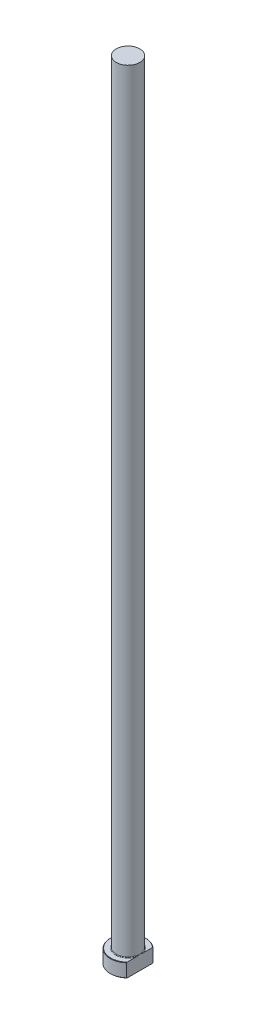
ISO-10303-21;
HEADER;
FILE_DESCRIPTION(('STEP AP214'),'2;1');
FILE_NAME('part.step','',(''),(''),'','','');
FILE_SCHEMA(('AUTOMOTIVE_DESIGN { 1 0 10303 214 1 1 1 1 }'));
ENDSEC;
DATA;
#1=APPLICATION_CONTEXT('core data for automotive mechanical design processes');
#2=APPLICATION_PROTOCOL_DEFINITION('international standard','automotive_design',2000,#1);
#3=PRODUCT_CONTEXT('',#1,'mechanical');
#4=PRODUCT('Part','Part','',(#3));
#5=PRODUCT_RELATED_PRODUCT_CATEGORY('part','',(#4));
#6=PRODUCT_DEFINITION_FORMATION('','',#4);
#7=PRODUCT_DEFINITION_CONTEXT('part definition',#1,'design');
#8=PRODUCT_DEFINITION('design','',#6,#7);
#9=PRODUCT_DEFINITION_SHAPE('','',#8);
#10=(LENGTH_UNIT() NAMED_UNIT(*) SI_UNIT(.MILLI.,.METRE.));
#11=(NAMED_UNIT(*) PLANE_ANGLE_UNIT() SI_UNIT($,.RADIAN.));
#12=(NAMED_UNIT(*) SI_UNIT($,.STERADIAN.) SOLID_ANGLE_UNIT());
#13=UNCERTAINTY_MEASURE_WITH_UNIT(LENGTH_MEASURE(1.E-05),#10,'distance_accuracy_value','');
#14=(GEOMETRIC_REPRESENTATION_CONTEXT(3) GLOBAL_UNCERTAINTY_ASSIGNED_CONTEXT((#13)) GLOBAL_UNIT_ASSIGNED_CONTEXT((#10,
#11,#12)) REPRESENTATION_CONTEXT('',''));
#15=CARTESIAN_POINT('',(0.,0.,0.));
#16=DIRECTION('',(0.,0.,1.));
#17=DIRECTION('',(1.,0.,0.));
#18=AXIS2_PLACEMENT_3D('',#15,#16,#17);
#19=CARTESIAN_POINT('',(0.,0.,0.));
#20=DIRECTION('',(0.,-1.,0.));
#21=DIRECTION('',(0.,0.,-1.));
#22=AXIS2_PLACEMENT_3D('',#19,#20,#21);
#23=PLANE('',#22);
#24=CARTESIAN_POINT('',(0.,0.,0.));
#25=DIRECTION('',(0.,-1.,0.));
#26=DIRECTION('',(0.,0.,-1.));
#27=AXIS2_PLACEMENT_3D('',#24,#25,#26);
#28=CIRCLE('',#27,8.79999999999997);
#29=CARTESIAN_POINT('',(5.99999999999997,0.,6.43739077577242));
#30=VERTEX_POINT('',#29);
#31=CARTESIAN_POINT('',(5.99999999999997,0.,-6.43739077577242));
#32=VERTEX_POINT('',#31);
#33=EDGE_CURVE('E98',#30,#32,#28,.T.);
#34=ORIENTED_EDGE('',*,*,#33,.T.);
#35=DIRECTION('',(0.,0.,1.));
#36=VECTOR('',#35,1.);
#37=CARTESIAN_POINT('',(5.99999999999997,0.,-6.70820393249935));
#38=LINE('',#37,#36);
#39=EDGE_CURVE('E83',#32,#30,#38,.T.);
#40=ORIENTED_EDGE('',*,*,#39,.T.);
#41=EDGE_LOOP('',(#34,#40));
#42=FACE_BOUND('',#41,.T.);
#43=ADVANCED_FACE('F32',(#42),#23,.T.);
#44=CARTESIAN_POINT('',(0.,259.958771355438,0.));
#45=DIRECTION('',(0.,1.,0.));
#46=DIRECTION('',(0.,0.,1.));
#47=AXIS2_PLACEMENT_3D('',#44,#45,#46);
#48=CYLINDRICAL_SURFACE('',#47,8.99999999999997);
#49=CARTESIAN_POINT('',(0.,6.79999999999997,0.));
#50=DIRECTION('',(0.,1.,0.));
#51=DIRECTION('',(0.,0.,1.));
#52=AXIS2_PLACEMENT_3D('',#49,#50,#51);
#53=CIRCLE('',#52,8.99999999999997);
#54=CARTESIAN_POINT('',(5.99999999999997,6.79999999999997,6.70820393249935));
#55=VERTEX_POINT('',#54);
#56=CARTESIAN_POINT('',(5.99999999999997,6.79999999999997,-6.70820393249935));
#57=VERTEX_POINT('',#56);
#58=EDGE_CURVE('E104',#55,#57,#53,.F.);
#59=ORIENTED_EDGE('',*,*,#58,.T.);
#60=DIRECTION('',(0.,-1.,0.));
#61=VECTOR('',#60,1.);
#62=CARTESIAN_POINT('',(5.99999999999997,400.,-6.70820393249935));
#63=LINE('',#62,#61);
#64=CARTESIAN_POINT('',(5.99999999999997,0.200000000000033,-6.70820393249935));
#65=VERTEX_POINT('',#64);
#66=EDGE_CURVE('E183',#57,#65,#63,.T.);
#67=ORIENTED_EDGE('',*,*,#66,.T.);
#68=CARTESIAN_POINT('',(0.,0.200000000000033,0.));
#69=DIRECTION('',(0.,-1.,0.));
#70=DIRECTION('',(0.,0.,-1.));
#71=AXIS2_PLACEMENT_3D('',#68,#69,#70);
#72=CIRCLE('',#71,8.99999999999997);
#73=CARTESIAN_POINT('',(5.99999999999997,0.200000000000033,6.70820393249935));
#74=VERTEX_POINT('',#73);
#75=EDGE_CURVE('E100',#65,#74,#72,.F.);
#76=ORIENTED_EDGE('',*,*,#75,.T.);
#77=DIRECTION('',(0.,-1.,0.));
#78=VECTOR('',#77,1.);
#79=CARTESIAN_POINT('',(5.99999999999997,400.,6.70820393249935));
#80=LINE('',#79,#78);
#81=EDGE_CURVE('E93',#55,#74,#80,.T.);
#82=ORIENTED_EDGE('',*,*,#81,.F.);
#83=EDGE_LOOP('',(#59,#67,#76,#82));
#84=FACE_BOUND('',#83,.T.);
#85=ADVANCED_FACE('F158',(#84),#48,.T.);
#86=CARTESIAN_POINT('',(-8.99999999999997,7.,0.));
#87=DIRECTION('',(0.,1.,0.));
#88=DIRECTION('',(0.,0.,1.));
#89=AXIS2_PLACEMENT_3D('',#86,#87,#88);
#90=PLANE('',#89);
#91=CARTESIAN_POINT('',(0.,7.,0.));
#92=DIRECTION('',(0.,1.,0.));
#93=DIRECTION('',(0.,0.,1.));
#94=AXIS2_PLACEMENT_3D('',#91,#92,#93);
#95=CIRCLE('',#94,8.79999999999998);
#96=CARTESIAN_POINT('',(5.99999999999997,7.,-6.43739077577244));
#97=VERTEX_POINT('',#96);
#98=CARTESIAN_POINT('',(5.99999999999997,7.,6.43739077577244));
#99=VERTEX_POINT('',#98);
#100=EDGE_CURVE('E178',#97,#99,#95,.T.);
#101=ORIENTED_EDGE('',*,*,#100,.T.);
#102=DIRECTION('',(0.,0.,-1.));
#103=VECTOR('',#102,1.);
#104=CARTESIAN_POINT('',(5.99999999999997,7.,0.));
#105=LINE('',#104,#103);
#106=CARTESIAN_POINT('',(5.99999999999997,6.99999999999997,1.92093727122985));
#107=VERTEX_POINT('',#106);
#108=EDGE_CURVE('E57',#99,#107,#105,.T.);
#109=ORIENTED_EDGE('',*,*,#108,.T.);
#110=CARTESIAN_POINT('',(0.,7.,0.));
#111=DIRECTION('',(0.,1.,0.));
#112=DIRECTION('',(0.,0.,1.));
#113=AXIS2_PLACEMENT_3D('',#110,#111,#112);
#114=CIRCLE('',#113,6.29999999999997);
#115=CARTESIAN_POINT('',(5.99999999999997,6.99999999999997,-1.92093727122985));
#116=VERTEX_POINT('',#115);
#117=EDGE_CURVE('E107',#107,#116,#114,.F.);
#118=ORIENTED_EDGE('',*,*,#117,.T.);
#119=EDGE_CURVE('E136',#116,#97,#105,.T.);
#120=ORIENTED_EDGE('',*,*,#119,.T.);
#121=EDGE_LOOP('',(#101,#109,#118,#120));
#122=FACE_BOUND('',#121,.T.);
#123=ADVANCED_FACE('F147',(#122),#90,.T.);
#124=CARTESIAN_POINT('',(0.,7.00000000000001,0.));
#125=DIRECTION('',(0.,-1.,0.));
#126=DIRECTION('',(0.,0.,-1.));
#127=AXIS2_PLACEMENT_3D('',#124,#125,#126);
#128=CONICAL_SURFACE('',#127,8.79999999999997,0.785398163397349);
#129=ORIENTED_EDGE('',*,*,#58,.F.);
#130=CARTESIAN_POINT('',(5.99999999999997,-0.132115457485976,14.7591430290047));
#131=CARTESIAN_POINT('',(5.99999999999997,0.0733919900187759,14.5372990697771));
#132=CARTESIAN_POINT('',(5.99999999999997,0.278550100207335,14.315131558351));
#133=CARTESIAN_POINT('',(5.99999999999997,0.688060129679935,13.8700519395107));
#134=CARTESIAN_POINT('',(5.99999999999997,0.892412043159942,13.6471398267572));
#135=CARTESIAN_POINT('',(5.99999999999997,1.50418032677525,12.9770492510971));
#136=CARTESIAN_POINT('',(5.99999999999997,1.9102209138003,12.5286117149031));
#137=CARTESIAN_POINT('',(5.99999999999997,2.7198013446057,11.624642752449));
#138=CARTESIAN_POINT('',(5.99999999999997,3.12331180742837,11.1690849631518));
#139=CARTESIAN_POINT('',(5.99999999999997,3.92341525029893,10.2520077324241));
#140=CARTESIAN_POINT('',(5.99999999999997,4.32000903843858,9.79048899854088));
#141=CARTESIAN_POINT('',(5.99999999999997,5.02478816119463,8.95241885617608));
#142=CARTESIAN_POINT('',(5.99999999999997,5.33476112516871,8.57737771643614));
#143=CARTESIAN_POINT('',(5.99999999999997,5.79310598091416,8.00939108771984));
#144=CARTESIAN_POINT('',(5.99999999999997,5.94480562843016,7.81913145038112));
#145=CARTESIAN_POINT('',(5.99999999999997,6.24553651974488,7.43651727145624));
#146=CARTESIAN_POINT('',(5.99999999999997,6.39456781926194,7.24416277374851));
#147=CARTESIAN_POINT('',(5.99999999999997,6.6892536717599,6.85721540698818));
#148=CARTESIAN_POINT('',(5.99999999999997,6.83491177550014,6.66262524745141));
#149=CARTESIAN_POINT('',(5.99999999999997,7.1223071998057,6.27057707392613));
#150=CARTESIAN_POINT('',(5.99999999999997,7.26404470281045,6.07311919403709));
#151=CARTESIAN_POINT('',(5.99999999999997,7.54263362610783,5.67488713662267));
#152=CARTESIAN_POINT('',(5.99999999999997,7.67948689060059,5.47411425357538));
#153=CARTESIAN_POINT('',(5.99999999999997,7.94714213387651,5.06858845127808));
#154=CARTESIAN_POINT('',(5.99999999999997,8.07794479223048,4.86383598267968));
#155=CARTESIAN_POINT('',(5.99999999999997,8.32827993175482,4.45554322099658));
#156=CARTESIAN_POINT('',(5.99999999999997,8.44802771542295,4.25213564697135));
#157=CARTESIAN_POINT('',(5.99999999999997,8.67837972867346,3.8401373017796));
#158=CARTESIAN_POINT('',(5.99999999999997,8.78898293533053,3.63154595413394));
#159=CARTESIAN_POINT('',(5.99999999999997,8.9984098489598,3.20863811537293));
#160=CARTESIAN_POINT('',(5.99999999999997,9.09724073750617,2.99432521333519));
#161=CARTESIAN_POINT('',(5.99999999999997,9.27991776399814,2.55937061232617));
#162=CARTESIAN_POINT('',(5.99999999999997,9.36376811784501,2.33873071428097));
#163=CARTESIAN_POINT('',(5.99999999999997,9.49627737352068,1.94012294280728));
#164=CARTESIAN_POINT('',(5.99999999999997,9.5486217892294,1.76338731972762));
#165=CARTESIAN_POINT('',(5.99999999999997,9.639780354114,1.40643307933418));
#166=CARTESIAN_POINT('',(5.99999999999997,9.67859618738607,1.22621489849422));
#167=CARTESIAN_POINT('',(5.99999999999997,9.74077317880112,0.863704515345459));
#168=CARTESIAN_POINT('',(5.99999999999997,9.76418479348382,0.681421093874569));
#169=CARTESIAN_POINT('',(5.99999999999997,9.7944781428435,0.315473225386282));
#170=CARTESIAN_POINT('',(5.99999999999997,9.80136083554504,0.131808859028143));
#171=CARTESIAN_POINT('',(5.99999999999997,9.79818788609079,-0.235881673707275));
#172=CARTESIAN_POINT('',(5.99999999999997,9.78808514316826,-0.419907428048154));
#173=CARTESIAN_POINT('',(5.99999999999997,9.75144464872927,-0.786302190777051));
#174=CARTESIAN_POINT('',(5.99999999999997,9.72490559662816,-0.968671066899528));
#175=CARTESIAN_POINT('',(5.99999999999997,9.65670736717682,-1.33110767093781));
#176=CARTESIAN_POINT('',(5.99999999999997,9.61500120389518,-1.5111664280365));
#177=CARTESIAN_POINT('',(5.99999999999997,9.5183832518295,-1.86766519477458));
#178=CARTESIAN_POINT('',(5.99999999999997,9.46347085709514,-2.04410503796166));
#179=CARTESIAN_POINT('',(5.99999999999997,9.33563659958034,-2.41270922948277));
#180=CARTESIAN_POINT('',(5.99999999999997,9.26138327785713,-2.60440790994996));
#181=CARTESIAN_POINT('',(5.99999999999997,9.10155310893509,-2.98306496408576));
#182=CARTESIAN_POINT('',(5.99999999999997,9.01597146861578,-3.1700212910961));
#183=CARTESIAN_POINT('',(5.99999999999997,8.83553473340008,-3.53975380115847));
#184=CARTESIAN_POINT('',(5.99999999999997,8.74066449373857,-3.72252253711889));
#185=CARTESIAN_POINT('',(5.99999999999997,8.5435547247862,-4.08398624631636));
#186=CARTESIAN_POINT('',(5.99999999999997,8.44131612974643,-4.26268173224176));
#187=CARTESIAN_POINT('',(5.99999999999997,8.22953960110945,-4.61872309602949));
#188=CARTESIAN_POINT('',(5.99999999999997,8.11992610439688,-4.79602381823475));
#189=CARTESIAN_POINT('',(5.99999999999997,7.8957104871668,-5.14743548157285));
#190=CARTESIAN_POINT('',(5.99999999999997,7.7811082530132,-5.32154634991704));
#191=CARTESIAN_POINT('',(5.99999999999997,7.5479278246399,-5.66682327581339));
#192=CARTESIAN_POINT('',(5.99999999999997,7.42935372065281,-5.83799210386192));
#193=CARTESIAN_POINT('',(5.99999999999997,7.18881616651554,-6.17793707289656));
#194=CARTESIAN_POINT('',(5.99999999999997,7.06685256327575,-6.34671310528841));
#195=CARTESIAN_POINT('',(5.99999999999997,6.80539778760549,-6.70216781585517));
#196=CARTESIAN_POINT('',(5.99999999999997,6.66554966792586,-6.88858356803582));
#197=CARTESIAN_POINT('',(5.99999999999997,6.38292065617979,-7.25918139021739));
#198=CARTESIAN_POINT('',(5.99999999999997,6.2401396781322,-7.44336339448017));
#199=CARTESIAN_POINT('',(5.99999999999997,5.80812002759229,-7.99307414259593));
#200=CARTESIAN_POINT('',(5.99999999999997,5.51523002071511,-8.35573349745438));
#201=CARTESIAN_POINT('',(5.99999999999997,4.92224619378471,-9.07562940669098));
#202=CARTESIAN_POINT('',(5.99999999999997,4.62214609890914,-9.43286076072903));
#203=CARTESIAN_POINT('',(5.99999999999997,4.01677382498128,-10.1429201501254));
#204=CARTESIAN_POINT('',(5.99999999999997,3.71150152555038,-10.495748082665));
#205=CARTESIAN_POINT('',(5.99999999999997,3.1145679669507,-11.177916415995));
#206=CARTESIAN_POINT('',(5.99999999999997,2.82312451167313,-11.5074478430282));
#207=CARTESIAN_POINT('',(5.99999999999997,2.23747184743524,-12.1640528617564));
#208=CARTESIAN_POINT('',(5.99999999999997,1.94326258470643,-12.4911264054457));
#209=CARTESIAN_POINT('',(5.99999999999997,1.35320776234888,-13.1426363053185));
#210=CARTESIAN_POINT('',(5.99999999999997,1.05736649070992,-13.4670765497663));
#211=CARTESIAN_POINT('',(5.99999999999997,0.463882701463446,-14.1142803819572));
#212=CARTESIAN_POINT('',(5.99999999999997,0.166240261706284,-14.4370440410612));
#213=CARTESIAN_POINT('',(5.99999999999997,-0.132115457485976,-14.7591430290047));
#214=B_SPLINE_CURVE_WITH_KNOTS('',3,(#130,#131,#132,#133,#134,#135,#136,#137,#138,#139,#140,
#141,#142,#143,#144,#145,#146,#147,#148,#149,#150,#151,#152,#153,#154,#155,#156,#157,#158,#159,
#160,#161,#162,#163,#164,#165,#166,#167,#168,#169,#170,#171,#172,#173,#174,#175,#176,#177,#178,
#179,#180,#181,#182,#183,#184,#185,#186,#187,#188,#189,#190,#191,#192,#193,#194,#195,#196,#197,
#198,#199,#200,#201,#202,#203,#204,#205,#206,#207,#208,#209,#210,#211,#212,#213),.UNSPECIFIED.,
.F.,.F.,(4,2,2,2,2,2,2,2,2,2,2,2,2,2,2,2,2,2,2,2,2,2,2,2,2,2,2,2,2,2,2,2,2,2,2,2,2,2,2,2,2,4),
(0.,0.907210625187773,1.81442776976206,3.62925156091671,5.4549048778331,7.28034345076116,
8.73990838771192,9.4698921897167,10.1998607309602,10.9290223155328,11.6581499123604,
12.3869992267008,13.1157664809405,13.8236973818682,14.5317073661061,15.2392832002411,
15.9466595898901,16.4991819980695,17.0516356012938,17.6022705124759,18.1528735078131,
18.7050058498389,19.2571818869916,19.8110832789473,20.3650100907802,20.9812908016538,
21.597833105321,22.2153979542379,22.8328846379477,23.4581285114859,24.0833866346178,
24.7080195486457,25.3326807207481,26.0317691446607,26.7308780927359,28.1292235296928,
29.5288334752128,30.9284760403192,32.2482200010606,33.567989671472,34.8851960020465,
36.2023458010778),.UNSPECIFIED.);
#215=EDGE_CURVE('E135',#55,#99,#214,.T.);
#216=ORIENTED_EDGE('',*,*,#215,.T.);
#217=ORIENTED_EDGE('',*,*,#100,.F.);
#218=EDGE_CURVE('E127',#97,#57,#214,.T.);
#219=ORIENTED_EDGE('',*,*,#218,.T.);
#220=EDGE_LOOP('',(#129,#216,#217,#219));
#221=FACE_BOUND('',#220,.T.);
#222=ADVANCED_FACE('F143',(#221),#128,.T.);
#223=CARTESIAN_POINT('',(0.,0.200000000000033,0.));
#224=DIRECTION('',(0.,1.,0.));
#225=DIRECTION('',(0.,0.,1.));
#226=AXIS2_PLACEMENT_3D('',#223,#224,#225);
#227=CONICAL_SURFACE('',#226,8.99999999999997,0.785398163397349);
#228=ORIENTED_EDGE('',*,*,#75,.F.);
#229=CARTESIAN_POINT('',(5.99999999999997,7.13211545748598,-14.7591430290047));
#230=CARTESIAN_POINT('',(5.99999999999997,6.92660800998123,-14.5372990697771));
#231=CARTESIAN_POINT('',(5.99999999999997,6.72144989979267,-14.315131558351));
#232=CARTESIAN_POINT('',(5.99999999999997,6.31193987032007,-13.8700519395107));
#233=CARTESIAN_POINT('',(5.99999999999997,6.10758795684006,-13.6471398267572));
#234=CARTESIAN_POINT('',(5.99999999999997,5.49581967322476,-12.9770492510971));
#235=CARTESIAN_POINT('',(5.99999999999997,5.08977908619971,-12.5286117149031));
#236=CARTESIAN_POINT('',(5.99999999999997,4.28019865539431,-11.624642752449));
#237=CARTESIAN_POINT('',(5.99999999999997,3.87668819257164,-11.1690849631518));
#238=CARTESIAN_POINT('',(5.99999999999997,3.07658474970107,-10.2520077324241));
#239=CARTESIAN_POINT('',(5.99999999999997,2.67999096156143,-9.79048899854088));
#240=CARTESIAN_POINT('',(5.99999999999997,1.97521183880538,-8.95241885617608));
#241=CARTESIAN_POINT('',(5.99999999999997,1.6652388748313,-8.57737771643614));
#242=CARTESIAN_POINT('',(5.99999999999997,1.20689401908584,-8.00939108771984));
#243=CARTESIAN_POINT('',(5.99999999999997,1.05519437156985,-7.81913145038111));
#244=CARTESIAN_POINT('',(5.99999999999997,0.754463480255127,-7.43651727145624));
#245=CARTESIAN_POINT('',(5.99999999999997,0.60543218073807,-7.24416277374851));
#246=CARTESIAN_POINT('',(5.99999999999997,0.310746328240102,-6.85721540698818));
#247=CARTESIAN_POINT('',(5.99999999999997,0.16508822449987,-6.66262524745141));
#248=CARTESIAN_POINT('',(5.99999999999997,-0.122307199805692,-6.27057707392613));
#249=CARTESIAN_POINT('',(5.99999999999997,-0.264044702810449,-6.07311919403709));
#250=CARTESIAN_POINT('',(5.99999999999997,-0.542633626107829,-5.67488713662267));
#251=CARTESIAN_POINT('',(5.99999999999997,-0.679486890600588,-5.47411425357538));
#252=CARTESIAN_POINT('',(5.99999999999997,-0.947142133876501,-5.06858845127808));
#253=CARTESIAN_POINT('',(5.99999999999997,-1.07794479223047,-4.86383598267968));
#254=CARTESIAN_POINT('',(5.99999999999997,-1.32827993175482,-4.45554322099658));
#255=CARTESIAN_POINT('',(5.99999999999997,-1.44802771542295,-4.25213564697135));
#256=CARTESIAN_POINT('',(5.99999999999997,-1.67837972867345,-3.8401373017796));
#257=CARTESIAN_POINT('',(5.99999999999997,-1.78898293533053,-3.63154595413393));
#258=CARTESIAN_POINT('',(5.99999999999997,-1.99840984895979,-3.20863811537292));
#259=CARTESIAN_POINT('',(5.99999999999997,-2.09724073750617,-2.99432521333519));
#260=CARTESIAN_POINT('',(5.99999999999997,-2.27991776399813,-2.55937061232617));
#261=CARTESIAN_POINT('',(5.99999999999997,-2.363768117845,-2.33873071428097));
#262=CARTESIAN_POINT('',(5.99999999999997,-2.49627737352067,-1.94012294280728));
#263=CARTESIAN_POINT('',(5.99999999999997,-2.54862178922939,-1.76338731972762));
#264=CARTESIAN_POINT('',(5.99999999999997,-2.63978035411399,-1.40643307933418));
#265=CARTESIAN_POINT('',(5.99999999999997,-2.67859618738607,-1.22621489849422));
#266=CARTESIAN_POINT('',(5.99999999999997,-2.74077317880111,-0.86370451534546));
#267=CARTESIAN_POINT('',(5.99999999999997,-2.76418479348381,-0.681421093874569));
#268=CARTESIAN_POINT('',(5.99999999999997,-2.79447814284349,-0.315473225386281));
#269=CARTESIAN_POINT('',(5.99999999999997,-2.80136083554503,-0.131808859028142));
#270=CARTESIAN_POINT('',(5.99999999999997,-2.79818788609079,0.235881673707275));
#271=CARTESIAN_POINT('',(5.99999999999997,-2.78808514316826,0.419907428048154));
#272=CARTESIAN_POINT('',(5.99999999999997,-2.75144464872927,0.786302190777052));
#273=CARTESIAN_POINT('',(5.99999999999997,-2.72490559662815,0.96867106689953));
#274=CARTESIAN_POINT('',(5.99999999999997,-2.65670736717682,1.33110767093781));
#275=CARTESIAN_POINT('',(5.99999999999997,-2.61500120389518,1.5111664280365));
#276=CARTESIAN_POINT('',(5.99999999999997,-2.5183832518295,1.86766519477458));
#277=CARTESIAN_POINT('',(5.99999999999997,-2.46347085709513,2.04410503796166));
#278=CARTESIAN_POINT('',(5.99999999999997,-2.33563659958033,2.41270922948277));
#279=CARTESIAN_POINT('',(5.99999999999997,-2.26138327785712,2.60440790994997));
#280=CARTESIAN_POINT('',(5.99999999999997,-2.10155310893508,2.98306496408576));
#281=CARTESIAN_POINT('',(5.99999999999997,-2.01597146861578,3.17002129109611));
#282=CARTESIAN_POINT('',(5.99999999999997,-1.83553473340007,3.53975380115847));
#283=CARTESIAN_POINT('',(5.99999999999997,-1.74066449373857,3.7225225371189));
#284=CARTESIAN_POINT('',(5.99999999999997,-1.54355472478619,4.08398624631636));
#285=CARTESIAN_POINT('',(5.99999999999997,-1.44131612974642,4.26268173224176));
#286=CARTESIAN_POINT('',(5.99999999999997,-1.22953960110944,4.6187230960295));
#287=CARTESIAN_POINT('',(5.99999999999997,-1.11992610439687,4.79602381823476));
#288=CARTESIAN_POINT('',(5.99999999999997,-0.895710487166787,5.14743548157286));
#289=CARTESIAN_POINT('',(5.99999999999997,-0.781108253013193,5.32154634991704));
#290=CARTESIAN_POINT('',(5.99999999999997,-0.547927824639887,5.6668232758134));
#291=CARTESIAN_POINT('',(5.99999999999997,-0.429353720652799,5.83799210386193));
#292=CARTESIAN_POINT('',(5.99999999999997,-0.188816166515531,6.17793707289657));
#293=CARTESIAN_POINT('',(5.99999999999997,-0.066852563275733,6.34671310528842));
#294=CARTESIAN_POINT('',(5.99999999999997,0.194602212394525,6.70216781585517));
#295=CARTESIAN_POINT('',(5.99999999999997,0.334450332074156,6.88858356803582));
#296=CARTESIAN_POINT('',(5.99999999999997,0.61707934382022,7.2591813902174));
#297=CARTESIAN_POINT('',(5.99999999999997,0.759860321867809,7.44336339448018));
#298=CARTESIAN_POINT('',(5.99999999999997,1.19187997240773,7.99307414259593));
#299=CARTESIAN_POINT('',(5.99999999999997,1.4847699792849,8.35573349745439));
#300=CARTESIAN_POINT('',(5.99999999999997,2.0777538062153,9.07562940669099));
#301=CARTESIAN_POINT('',(5.99999999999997,2.37785390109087,9.43286076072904));
#302=CARTESIAN_POINT('',(5.99999999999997,2.98322617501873,10.1429201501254));
#303=CARTESIAN_POINT('',(5.99999999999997,3.28849847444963,10.495748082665));
#304=CARTESIAN_POINT('',(5.99999999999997,3.88543203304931,11.177916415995));
#305=CARTESIAN_POINT('',(5.99999999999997,4.17687548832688,11.5074478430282));
#306=CARTESIAN_POINT('',(5.99999999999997,4.76252815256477,12.1640528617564));
#307=CARTESIAN_POINT('',(5.99999999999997,5.05673741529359,12.4911264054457));
#308=CARTESIAN_POINT('',(5.99999999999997,5.64679223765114,13.1426363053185));
#309=CARTESIAN_POINT('',(5.99999999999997,5.94263350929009,13.4670765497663));
#310=CARTESIAN_POINT('',(5.99999999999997,6.53611729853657,14.1142803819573));
#311=CARTESIAN_POINT('',(5.99999999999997,6.83375973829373,14.4370440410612));
#312=CARTESIAN_POINT('',(5.99999999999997,7.13211545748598,14.7591430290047));
#313=B_SPLINE_CURVE_WITH_KNOTS('',3,(#229,#230,#231,#232,#233,#234,#235,#236,#237,#238,#239,
#240,#241,#242,#243,#244,#245,#246,#247,#248,#249,#250,#251,#252,#253,#254,#255,#256,#257,#258,
#259,#260,#261,#262,#263,#264,#265,#266,#267,#268,#269,#270,#271,#272,#273,#274,#275,#276,#277,
#278,#279,#280,#281,#282,#283,#284,#285,#286,#287,#288,#289,#290,#291,#292,#293,#294,#295,#296,
#297,#298,#299,#300,#301,#302,#303,#304,#305,#306,#307,#308,#309,#310,#311,#312),.UNSPECIFIED.,
.F.,.F.,(4,2,2,2,2,2,2,2,2,2,2,2,2,2,2,2,2,2,2,2,2,2,2,2,2,2,2,2,2,2,2,2,2,2,2,2,2,2,2,2,2,4),
(0.,0.907210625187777,1.81442776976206,3.62925156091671,5.4549048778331,7.28034345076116,
8.73990838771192,9.46989218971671,10.1998607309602,10.9290223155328,11.6581499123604,
12.3869992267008,13.1157664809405,13.8236973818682,14.5317073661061,15.2392832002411,
15.9466595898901,16.4991819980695,17.0516356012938,17.6022705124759,18.1528735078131,
18.7050058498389,19.2571818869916,19.8110832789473,20.3650100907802,20.9812908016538,
21.597833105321,22.215397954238,22.8328846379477,23.4581285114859,24.0833866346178,
24.7080195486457,25.3326807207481,26.0317691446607,26.7308780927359,28.1292235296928,
29.5288334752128,30.9284760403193,32.2482200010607,33.567989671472,34.8851960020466,
36.2023458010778),.UNSPECIFIED.);
#314=EDGE_CURVE('E86',#65,#32,#313,.T.);
#315=ORIENTED_EDGE('',*,*,#314,.T.);
#316=ORIENTED_EDGE('',*,*,#33,.F.);
#317=EDGE_CURVE('E89',#30,#74,#313,.T.);
#318=ORIENTED_EDGE('',*,*,#317,.T.);
#319=EDGE_LOOP('',(#228,#315,#316,#318));
#320=FACE_BOUND('',#319,.T.);
#321=ADVANCED_FACE('F97',(#320),#227,.T.);
#322=CARTESIAN_POINT('',(0.,7.29999999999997,0.));
#323=DIRECTION('',(0.,1.,0.));
#324=DIRECTION('',(0.,0.,1.));
#325=AXIS2_PLACEMENT_3D('',#322,#323,#324);
#326=TOROIDAL_SURFACE('',#325,6.29999999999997,0.3);
#327=CARTESIAN_POINT('',(5.99999999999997,7.29999999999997,0.));
#328=CARTESIAN_POINT('',(5.99999999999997,7.30000062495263,1.34604287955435E-10));
#329=CARTESIAN_POINT('',(5.99999999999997,7.30000124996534,-2.85495107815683E-07));
#330=CARTESIAN_POINT('',(5.99999999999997,7.30000241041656,-1.04928090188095E-06));
#331=CARTESIAN_POINT('',(5.99999999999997,7.30000292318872,-1.54785170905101E-06));
#332=CARTESIAN_POINT('',(5.99999999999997,7.30000401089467,-2.74944383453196E-06));
#333=CARTESIAN_POINT('',(5.99999999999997,7.30000456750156,-3.47196539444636E-06));
#334=CARTESIAN_POINT('',(5.99999999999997,7.30000554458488,-4.95172582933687E-06));
#335=CARTESIAN_POINT('',(5.99999999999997,7.30000596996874,-5.70604365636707E-06));
#336=CARTESIAN_POINT('',(5.99999999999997,7.30000759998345,-8.69525109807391E-06));
#337=CARTESIAN_POINT('',(5.99999999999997,7.30000872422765,-1.0978182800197E-05));
#338=CARTESIAN_POINT('',(5.99999999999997,7.30001052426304,-1.54456346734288E-05));
#339=CARTESIAN_POINT('',(5.99999999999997,7.3000112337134,-1.76170762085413E-05));
#340=CARTESIAN_POINT('',(5.99999999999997,7.30001429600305,-2.69928123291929E-05));
#341=CARTESIAN_POINT('',(5.99999999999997,7.30001664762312,-3.42000265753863E-05));
#342=CARTESIAN_POINT('',(5.99999999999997,7.30002002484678,-4.76829001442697E-05));
#343=CARTESIAN_POINT('',(5.99999999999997,7.30002120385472,-5.39195609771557E-05));
#344=CARTESIAN_POINT('',(5.99999999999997,7.30002992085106,-0.000100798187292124));
#345=CARTESIAN_POINT('',(5.99999999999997,7.30003667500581,-0.00014152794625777));
#346=CARTESIAN_POINT('',(5.99999999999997,7.30006623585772,-0.000303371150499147));
#347=CARTESIAN_POINT('',(5.99999999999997,7.30009428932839,-0.000423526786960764));
#348=CARTESIAN_POINT('',(5.99999999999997,7.30020425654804,-0.000901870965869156));
#349=CARTESIAN_POINT('',(5.99999999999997,7.3002828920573,-0.00126055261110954));
#350=CARTESIAN_POINT('',(5.99999999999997,7.30059934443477,-0.0026940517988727));
#351=CARTESIAN_POINT('',(5.99999999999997,7.3008413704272,-0.0037682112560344));
#352=CARTESIAN_POINT('',(5.99999999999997,7.30185255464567,-0.0082672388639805));
#353=CARTESIAN_POINT('',(5.99999999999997,7.30261638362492,-0.0116929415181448));
#354=CARTESIAN_POINT('',(5.99999999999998,7.30945824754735,-0.0423635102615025));
#355=CARTESIAN_POINT('',(5.99999999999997,7.31555811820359,-0.0696050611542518));
#356=CARTESIAN_POINT('',(5.99999999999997,7.32747716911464,-0.122985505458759));
#357=CARTESIAN_POINT('',(5.99999999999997,7.33329766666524,-0.149124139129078));
#358=CARTESIAN_POINT('',(5.99999999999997,7.34565922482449,-0.204790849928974));
#359=CARTESIAN_POINT('',(5.99999999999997,7.352196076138,-0.234319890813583));
#360=CARTESIAN_POINT('',(5.99999999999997,7.36527652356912,-0.29372170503));
#361=CARTESIAN_POINT('',(5.99999999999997,7.37181938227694,-0.323594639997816));
#362=CARTESIAN_POINT('',(5.99999999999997,7.38741819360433,-0.395325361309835));
#363=CARTESIAN_POINT('',(5.99999999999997,7.39643140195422,-0.437192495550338));
#364=CARTESIAN_POINT('',(5.99999999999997,7.41397520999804,-0.519837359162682));
#365=CARTESIAN_POINT('',(5.99999999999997,7.4225122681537,-0.560613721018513));
#366=CARTESIAN_POINT('',(5.99999999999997,7.45005469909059,-0.694529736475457));
#367=CARTESIAN_POINT('',(5.99999999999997,7.46845270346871,-0.787796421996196));
#368=CARTESIAN_POINT('',(5.99999999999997,7.50309772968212,-0.975673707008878));
#369=CARTESIAN_POINT('',(5.99999999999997,7.51932210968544,-1.07028855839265));
#370=CARTESIAN_POINT('',(5.99999999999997,7.54979671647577,-1.26922112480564));
#371=CARTESIAN_POINT('',(5.99999999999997,7.56370439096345,-1.37359247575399));
#372=CARTESIAN_POINT('',(5.99999999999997,7.58567213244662,-1.58267692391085));
#373=CARTESIAN_POINT('',(5.99999999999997,7.59375049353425,-1.68738790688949));
#374=CARTESIAN_POINT('',(5.99999999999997,7.59943466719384,-1.8430899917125));
#375=CARTESIAN_POINT('',(5.99999999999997,7.60029184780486,-1.89396002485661));
#376=CARTESIAN_POINT('',(5.99999999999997,7.5995288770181,-1.99574511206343));
#377=CARTESIAN_POINT('',(5.99999999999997,7.59790613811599,-2.04666015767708));
#378=CARTESIAN_POINT('',(5.99999999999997,7.59158346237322,-2.14740525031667));
#379=CARTESIAN_POINT('',(5.99999999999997,7.58693864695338,-2.19723851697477));
#380=CARTESIAN_POINT('',(5.99999999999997,7.57369485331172,-2.29634018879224));
#381=CARTESIAN_POINT('',(5.99999999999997,7.56510170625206,-2.3456093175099));
#382=CARTESIAN_POINT('',(5.99999999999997,7.54513600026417,-2.43101613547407));
#383=CARTESIAN_POINT('',(5.99999999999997,7.53495732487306,-2.46741817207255));
#384=CARTESIAN_POINT('',(5.99999999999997,7.5163599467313,-2.52083307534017));
#385=CARTESIAN_POINT('',(5.99999999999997,7.50961541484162,-2.53842082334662));
#386=CARTESIAN_POINT('',(5.99999999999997,7.49476050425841,-2.57300282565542));
#387=CARTESIAN_POINT('',(5.99999999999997,7.48665036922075,-2.58999718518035));
#388=CARTESIAN_POINT('',(5.99999999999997,7.4656679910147,-2.62872971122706));
#389=CARTESIAN_POINT('',(5.99999999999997,7.45211281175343,-2.65012863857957));
#390=CARTESIAN_POINT('',(5.99999999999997,7.42848584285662,-2.67978235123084));
#391=CARTESIAN_POINT('',(5.99999999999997,7.42001211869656,-2.68929941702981));
#392=CARTESIAN_POINT('',(5.99999999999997,7.40175979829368,-2.70700164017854));
#393=CARTESIAN_POINT('',(5.99999999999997,7.39198420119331,-2.71518976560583));
#394=CARTESIAN_POINT('',(5.99999999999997,7.37475773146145,-2.7269570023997));
#395=CARTESIAN_POINT('',(5.99999999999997,7.36772137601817,-2.73113834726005));
#396=CARTESIAN_POINT('',(5.99999999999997,7.35309194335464,-2.73838811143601));
#397=CARTESIAN_POINT('',(5.99999999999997,7.34549938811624,-2.7414575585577));
#398=CARTESIAN_POINT('',(5.99999999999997,7.32979919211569,-2.74623687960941));
#399=CARTESIAN_POINT('',(5.99999999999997,7.32168697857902,-2.74793213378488));
#400=CARTESIAN_POINT('',(5.99999999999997,7.30528814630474,-2.74970225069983));
#401=CARTESIAN_POINT('',(5.99999999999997,7.29700168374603,-2.74977850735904));
#402=CARTESIAN_POINT('',(5.99999999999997,7.2816016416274,-2.74839814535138));
#403=CARTESIAN_POINT('',(5.99999999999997,7.27447007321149,-2.74713049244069));
#404=CARTESIAN_POINT('',(5.99999999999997,7.26050316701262,-2.74347158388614));
#405=CARTESIAN_POINT('',(5.99999999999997,7.25366802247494,-2.7410796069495));
#406=CARTESIAN_POINT('',(5.99999999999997,7.23783277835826,-2.73423902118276));
#407=CARTESIAN_POINT('',(5.99999999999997,7.22902314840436,-2.72935244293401));
#408=CARTESIAN_POINT('',(5.99999999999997,7.21228574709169,-2.7182516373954));
#409=CARTESIAN_POINT('',(5.99999999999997,7.20436026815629,-2.71203407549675));
#410=CARTESIAN_POINT('',(5.99999999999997,7.18433696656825,-2.69420240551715));
#411=CARTESIAN_POINT('',(5.99999999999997,7.17298706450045,-2.68175715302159));
#412=CARTESIAN_POINT('',(5.99999999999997,7.15219498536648,-2.65539556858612));
#413=CARTESIAN_POINT('',(5.99999999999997,7.14275658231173,-2.64147640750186));
#414=CARTESIAN_POINT('',(5.99999999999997,7.12508934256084,-2.61223187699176));
#415=CARTESIAN_POINT('',(5.99999999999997,7.11691464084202,-2.59687428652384));
#416=CARTESIAN_POINT('',(5.99999999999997,7.10186133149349,-2.56552911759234));
#417=CARTESIAN_POINT('',(5.99999999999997,7.09498416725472,-2.54954086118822));
#418=CARTESIAN_POINT('',(5.99999999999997,7.07586257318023,-2.50075322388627));
#419=CARTESIAN_POINT('',(5.99999999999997,7.06523495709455,-2.46732486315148));
#420=CARTESIAN_POINT('',(5.99999999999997,7.04175411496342,-2.38014114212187));
#421=CARTESIAN_POINT('',(5.99999999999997,7.0311656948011,-2.32580591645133));
#422=CARTESIAN_POINT('',(5.99999999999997,7.01502027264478,-2.21628778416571));
#423=CARTESIAN_POINT('',(5.99999999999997,7.00947977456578,-2.16110269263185));
#424=CARTESIAN_POINT('',(5.99999999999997,7.00227593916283,-2.05225433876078));
#425=CARTESIAN_POINT('',(5.99999999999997,7.00049528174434,-1.99859827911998));
#426=CARTESIAN_POINT('',(5.99999999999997,6.99968738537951,-1.89155586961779));
#427=CARTESIAN_POINT('',(5.99999999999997,7.00064591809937,-1.83816956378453));
#428=CARTESIAN_POINT('',(5.99999999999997,7.00516082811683,-1.72092619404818));
#429=CARTESIAN_POINT('',(5.99999999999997,7.0091939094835,-1.65708843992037));
#430=CARTESIAN_POINT('',(5.99999999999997,7.01973827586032,-1.52965474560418));
#431=CARTESIAN_POINT('',(5.99999999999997,7.02624848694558,-1.46605871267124));
#432=CARTESIAN_POINT('',(5.99999999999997,7.04143114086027,-1.33760082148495));
#433=CARTESIAN_POINT('',(5.99999999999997,7.05015116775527,-1.27274468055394));
#434=CARTESIAN_POINT('',(5.99999999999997,7.06927542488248,-1.14310871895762));
#435=CARTESIAN_POINT('',(5.99999999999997,7.07968406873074,-1.07832955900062));
#436=CARTESIAN_POINT('',(5.99999999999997,7.10594320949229,-0.924890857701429));
#437=CARTESIAN_POINT('',(5.99999999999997,7.12237584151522,-0.836331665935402));
#438=CARTESIAN_POINT('',(5.99999999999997,7.15676035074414,-0.660568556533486));
#439=CARTESIAN_POINT('',(5.99999999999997,7.17469265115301,-0.573360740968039));
#440=CARTESIAN_POINT('',(5.99999999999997,7.20946366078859,-0.409309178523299));
#441=CARTESIAN_POINT('',(5.99999999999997,7.22618667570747,-0.332440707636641));
#442=CARTESIAN_POINT('',(5.99999999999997,7.25202386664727,-0.215187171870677));
#443=CARTESIAN_POINT('',(5.99999999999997,7.26098977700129,-0.174768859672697));
#444=CARTESIAN_POINT('',(5.99999999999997,7.27885525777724,-0.0946083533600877));
#445=CARTESIAN_POINT('',(5.99999999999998,7.28775352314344,-0.0548658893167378));
#446=CARTESIAN_POINT('',(5.99999999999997,7.2973853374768,-0.0116849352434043));
#447=CARTESIAN_POINT('',(5.99999999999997,7.29815099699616,-0.0082512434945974));
#448=CARTESIAN_POINT('',(5.99999999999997,7.2991626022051,-0.00375043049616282));
#449=CARTESIAN_POINT('',(5.99999999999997,7.29940322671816,-0.00268247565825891));
#450=CARTESIAN_POINT('',(5.99999999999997,7.29971797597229,-0.0012566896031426));
#451=CARTESIAN_POINT('',(5.99999999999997,7.2997962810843,-0.000899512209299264));
#452=CARTESIAN_POINT('',(5.99999999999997,7.2999058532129,-0.000422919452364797));
#453=CARTESIAN_POINT('',(5.99999999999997,7.29993385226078,-0.000303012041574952));
#454=CARTESIAN_POINT('',(5.99999999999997,7.299963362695,-0.000141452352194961));
#455=CARTESIAN_POINT('',(5.99999999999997,7.29997011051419,-0.000100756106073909));
#456=CARTESIAN_POINT('',(5.99999999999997,7.29997881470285,-5.39118915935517E-05));
#457=CARTESIAN_POINT('',(5.99999999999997,7.29997999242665,-4.76769647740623E-05));
#458=CARTESIAN_POINT('',(5.99999999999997,7.29998336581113,-3.41977669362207E-05));
#459=CARTESIAN_POINT('',(5.99999999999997,7.29998571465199,-2.69924043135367E-05));
#460=CARTESIAN_POINT('',(5.99999999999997,7.29998877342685,-1.76186229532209E-05));
#461=CARTESIAN_POINT('',(5.99999999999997,7.29998948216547,-1.54473107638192E-05));
#462=CARTESIAN_POINT('',(5.99999999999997,7.29999128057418,-1.09800124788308E-05));
#463=CARTESIAN_POINT('',(5.99999999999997,7.29999240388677,-8.69708706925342E-06));
#464=CARTESIAN_POINT('',(5.99999999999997,7.29999403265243,-5.70776681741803E-06));
#465=CARTESIAN_POINT('',(5.99999999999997,7.29999445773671,-4.95337952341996E-06));
#466=CARTESIAN_POINT('',(5.99999999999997,7.29999543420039,-3.47342608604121E-06));
#467=CARTESIAN_POINT('',(5.99999999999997,7.29999599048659,-2.7507782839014E-06));
#468=CARTESIAN_POINT('',(5.99999999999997,7.29999707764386,-1.54889527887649E-06));
#469=CARTESIAN_POINT('',(5.99999999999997,7.29999759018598,-1.0501721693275E-06));
#470=CARTESIAN_POINT('',(5.99999999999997,7.29999875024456,-2.85992424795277E-07));
#471=CARTESIAN_POINT('',(5.99999999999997,7.29999937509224,-1.34594612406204E-10));
#472=CARTESIAN_POINT('',(5.99999999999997,7.29999999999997,0.));
#473=B_SPLINE_CURVE_WITH_KNOTS('',3,(#327,#328,#329,#330,#331,#332,#333,#334,#335,#336,#337,
#338,#339,#340,#341,#342,#343,#344,#345,#346,#347,#348,#349,#350,#351,#352,#353,#354,#355,#356,
#357,#358,#359,#360,#361,#362,#363,#364,#365,#366,#367,#368,#369,#370,#371,#372,#373,#374,#375,
#376,#377,#378,#379,#380,#381,#382,#383,#384,#385,#386,#387,#388,#389,#390,#391,#392,#393,#394,
#395,#396,#397,#398,#399,#400,#401,#402,#403,#404,#405,#406,#407,#408,#409,#410,#411,#412,#413,
#414,#415,#416,#417,#418,#419,#420,#421,#422,#423,#424,#425,#426,#427,#428,#429,#430,#431,#432,
#433,#434,#435,#436,#437,#438,#439,#440,#441,#442,#443,#444,#445,#446,#447,#448,#449,#450,#451,
#452,#453,#454,#455,#456,#457,#458,#459,#460,#461,#462,#463,#464,#465,#466,#467,#468,#469,#470,
#471,#472),.UNSPECIFIED.,.T.,.F.,(4,2,2,2,2,2,2,2,2,2,2,2,2,2,2,2,2,2,2,2,2,2,2,2,2,2,2,2,2,2,2,
2,2,2,2,2,2,2,2,2,2,2,2,2,2,2,2,2,2,2,2,2,2,2,2,2,2,2,2,2,2,2,2,2,2,2,2,2,2,2,2,2,4),(0.,
1.90630853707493E-06,4.0638928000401E-06,6.78060422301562E-06,9.37792731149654E-06,
1.69875448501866E-05,2.38342815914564E-05,4.65460519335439E-05,6.55661832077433E-05,
0.000189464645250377,0.000559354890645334,0.001661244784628,0.00496415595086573,
0.0154940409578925,0.0992404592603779,0.179577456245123,0.270309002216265,0.362052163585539,
0.490530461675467,0.615511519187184,0.900684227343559,1.1886283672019,1.50441328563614,
1.8192028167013,1.97178950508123,2.1245355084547,2.27457076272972,2.4243851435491,
2.53755667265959,2.59401506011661,2.65046338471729,2.72600079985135,2.76413970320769,
2.80219221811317,2.82667181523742,2.85112872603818,2.8758425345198,2.90053506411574,
2.92216471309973,2.94380825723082,2.97385970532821,3.00398734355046,3.05423323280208,
3.10457737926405,3.15668997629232,3.20886020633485,3.31385890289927,3.47955406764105,
3.64578904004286,3.80675522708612,3.96688682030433,4.15871791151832,4.35046593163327,
4.54675795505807,4.74357155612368,5.01375693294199,5.2808448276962,5.51684158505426,
5.64104475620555,5.76322108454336,5.77377554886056,5.77705938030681,5.77815664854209,
5.77852577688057,5.77864957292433,5.77866858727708,5.77869129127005,5.77869813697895,
5.77870574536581,5.77870834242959,5.77871105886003,5.77871321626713,5.77871512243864),.UNSPECIFIED.);
#474=CARTESIAN_POINT('',(5.99999999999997,7.29999999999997,0.));
#475=VERTEX_POINT('',#474);
#476=EDGE_CURVE('E11',#116,#475,#473,.T.);
#477=ORIENTED_EDGE('',*,*,#476,.F.);
#478=ORIENTED_EDGE('',*,*,#117,.F.);
#479=CARTESIAN_POINT('',(5.99999999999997,7.29999999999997,0.));
#480=CARTESIAN_POINT('',(5.99999999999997,7.29999937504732,-1.34604253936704E-10));
#481=CARTESIAN_POINT('',(5.99999999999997,7.29999875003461,2.85495107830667E-07));
#482=CARTESIAN_POINT('',(5.99999999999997,7.29999758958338,1.04928090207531E-06));
#483=CARTESIAN_POINT('',(5.99999999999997,7.29999707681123,1.54785170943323E-06));
#484=CARTESIAN_POINT('',(5.99999999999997,7.29999598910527,2.74944383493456E-06));
#485=CARTESIAN_POINT('',(5.99999999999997,7.29999543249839,3.47196539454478E-06));
#486=CARTESIAN_POINT('',(5.99999999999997,7.29999445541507,4.95172582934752E-06));
#487=CARTESIAN_POINT('',(5.99999999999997,7.29999403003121,5.70604365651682E-06));
#488=CARTESIAN_POINT('',(5.99999999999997,7.2999924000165,8.69525109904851E-06));
#489=CARTESIAN_POINT('',(5.99999999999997,7.2999912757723,1.09781828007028E-05));
#490=CARTESIAN_POINT('',(5.99999999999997,7.29998947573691,1.54456346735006E-05));
#491=CARTESIAN_POINT('',(5.99999999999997,7.29998876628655,1.76170762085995E-05));
#492=CARTESIAN_POINT('',(5.99999999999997,7.2999857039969,2.69928123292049E-05));
#493=CARTESIAN_POINT('',(5.99999999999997,7.29998335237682,3.42000265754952E-05));
#494=CARTESIAN_POINT('',(5.99999999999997,7.29997997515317,4.76829001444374E-05));
#495=CARTESIAN_POINT('',(5.99999999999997,7.29997879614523,5.39195609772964E-05));
#496=CARTESIAN_POINT('',(5.99999999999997,7.29997007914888,0.000100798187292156));
#497=CARTESIAN_POINT('',(5.99999999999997,7.29996332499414,0.000141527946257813));
#498=CARTESIAN_POINT('',(5.99999999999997,7.29993376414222,0.000303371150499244));
#499=CARTESIAN_POINT('',(5.99999999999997,7.29990571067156,0.00042352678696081));
#500=CARTESIAN_POINT('',(5.99999999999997,7.29979574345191,0.00090187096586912));
#501=CARTESIAN_POINT('',(5.99999999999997,7.29971710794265,0.00126055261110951));
#502=CARTESIAN_POINT('',(5.99999999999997,7.29940065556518,0.0026940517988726));
#503=CARTESIAN_POINT('',(5.99999999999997,7.29915862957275,0.00376821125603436));
#504=CARTESIAN_POINT('',(5.99999999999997,7.29814744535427,0.00826723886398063));
#505=CARTESIAN_POINT('',(5.99999999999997,7.29738361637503,0.0116929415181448));
#506=CARTESIAN_POINT('',(5.99999999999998,7.2905417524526,0.0423635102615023));
#507=CARTESIAN_POINT('',(5.99999999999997,7.28444188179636,0.0696050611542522));
#508=CARTESIAN_POINT('',(5.99999999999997,7.2725228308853,0.12298550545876));
#509=CARTESIAN_POINT('',(5.99999999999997,7.26670233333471,0.149124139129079));
#510=CARTESIAN_POINT('',(5.99999999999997,7.25434077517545,0.204790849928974));
#511=CARTESIAN_POINT('',(5.99999999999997,7.24780392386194,0.234319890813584));
#512=CARTESIAN_POINT('',(5.99999999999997,7.23472347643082,0.29372170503));
#513=CARTESIAN_POINT('',(5.99999999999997,7.228180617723,0.323594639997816));
#514=CARTESIAN_POINT('',(5.99999999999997,7.21258180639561,0.395325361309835));
#515=CARTESIAN_POINT('',(5.99999999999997,7.20356859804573,0.437192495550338));
#516=CARTESIAN_POINT('',(5.99999999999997,7.18602479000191,0.519837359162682));
#517=CARTESIAN_POINT('',(5.99999999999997,7.17748773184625,0.560613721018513));
#518=CARTESIAN_POINT('',(5.99999999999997,7.14994530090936,0.694529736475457));
#519=CARTESIAN_POINT('',(5.99999999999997,7.13154729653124,0.787796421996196));
#520=CARTESIAN_POINT('',(5.99999999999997,7.09690227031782,0.975673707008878));
#521=CARTESIAN_POINT('',(5.99999999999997,7.08067789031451,1.07028855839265));
#522=CARTESIAN_POINT('',(5.99999999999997,7.05020328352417,1.26922112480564));
#523=CARTESIAN_POINT('',(5.99999999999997,7.0362956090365,1.37359247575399));
#524=CARTESIAN_POINT('',(5.99999999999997,7.01432786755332,1.58267692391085));
#525=CARTESIAN_POINT('',(5.99999999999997,7.0062495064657,1.68738790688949));
#526=CARTESIAN_POINT('',(5.99999999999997,7.00056533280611,1.8430899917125));
#527=CARTESIAN_POINT('',(5.99999999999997,6.99970815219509,1.89396002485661));
#528=CARTESIAN_POINT('',(5.99999999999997,7.00047112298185,1.99574511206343));
#529=CARTESIAN_POINT('',(5.99999999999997,7.00209386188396,2.04666015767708));
#530=CARTESIAN_POINT('',(5.99999999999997,7.00841653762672,2.14740525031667));
#531=CARTESIAN_POINT('',(5.99999999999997,7.01306135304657,2.19723851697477));
#532=CARTESIAN_POINT('',(5.99999999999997,7.02630514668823,2.29634018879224));
#533=CARTESIAN_POINT('',(5.99999999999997,7.03489829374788,2.3456093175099));
#534=CARTESIAN_POINT('',(5.99999999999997,7.05486399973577,2.43101613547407));
#535=CARTESIAN_POINT('',(5.99999999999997,7.06504267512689,2.46741817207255));
#536=CARTESIAN_POINT('',(5.99999999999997,7.08364005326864,2.52083307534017));
#537=CARTESIAN_POINT('',(5.99999999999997,7.09038458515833,2.53842082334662));
#538=CARTESIAN_POINT('',(5.99999999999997,7.10523949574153,2.57300282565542));
#539=CARTESIAN_POINT('',(5.99999999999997,7.1133496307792,2.58999718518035));
#540=CARTESIAN_POINT('',(5.99999999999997,7.13433200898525,2.62872971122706));
#541=CARTESIAN_POINT('',(5.99999999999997,7.14788718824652,2.65012863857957));
#542=CARTESIAN_POINT('',(5.99999999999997,7.17151415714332,2.67978235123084));
#543=CARTESIAN_POINT('',(5.99999999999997,7.17998788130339,2.68929941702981));
#544=CARTESIAN_POINT('',(5.99999999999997,7.19824020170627,2.70700164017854));
#545=CARTESIAN_POINT('',(5.99999999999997,7.20801579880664,2.71518976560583));
#546=CARTESIAN_POINT('',(5.99999999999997,7.2252422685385,2.7269570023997));
#547=CARTESIAN_POINT('',(5.99999999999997,7.23227862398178,2.73113834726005));
#548=CARTESIAN_POINT('',(5.99999999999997,7.24690805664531,2.73838811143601));
#549=CARTESIAN_POINT('',(5.99999999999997,7.2545006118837,2.7414575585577));
#550=CARTESIAN_POINT('',(5.99999999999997,7.27020080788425,2.74623687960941));
#551=CARTESIAN_POINT('',(5.99999999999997,7.27831302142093,2.74793213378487));
#552=CARTESIAN_POINT('',(5.99999999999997,7.29471185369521,2.74970225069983));
#553=CARTESIAN_POINT('',(5.99999999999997,7.30299831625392,2.74977850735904));
#554=CARTESIAN_POINT('',(5.99999999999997,7.31839835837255,2.74839814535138));
#555=CARTESIAN_POINT('',(5.99999999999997,7.32552992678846,2.74713049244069));
#556=CARTESIAN_POINT('',(5.99999999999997,7.33949683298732,2.74347158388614));
#557=CARTESIAN_POINT('',(5.99999999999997,7.34633197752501,2.7410796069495));
#558=CARTESIAN_POINT('',(5.99999999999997,7.36216722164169,2.73423902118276));
#559=CARTESIAN_POINT('',(5.99999999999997,7.37097685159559,2.72935244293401));
#560=CARTESIAN_POINT('',(5.99999999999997,7.38771425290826,2.7182516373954));
#561=CARTESIAN_POINT('',(5.99999999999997,7.39563973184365,2.71203407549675));
#562=CARTESIAN_POINT('',(5.99999999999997,7.4156630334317,2.69420240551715));
#563=CARTESIAN_POINT('',(5.99999999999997,7.42701293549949,2.68175715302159));
#564=CARTESIAN_POINT('',(5.99999999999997,7.44780501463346,2.65539556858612));
#565=CARTESIAN_POINT('',(5.99999999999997,7.45724341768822,2.64147640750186));
#566=CARTESIAN_POINT('',(5.99999999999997,7.4749106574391,2.61223187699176));
#567=CARTESIAN_POINT('',(5.99999999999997,7.48308535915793,2.59687428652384));
#568=CARTESIAN_POINT('',(5.99999999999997,7.49813866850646,2.56552911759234));
#569=CARTESIAN_POINT('',(5.99999999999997,7.50501583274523,2.54954086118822));
#570=CARTESIAN_POINT('',(5.99999999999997,7.52413742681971,2.50075322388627));
#571=CARTESIAN_POINT('',(5.99999999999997,7.5347650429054,2.46732486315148));
#572=CARTESIAN_POINT('',(5.99999999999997,7.55824588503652,2.38014114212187));
#573=CARTESIAN_POINT('',(5.99999999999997,7.56883430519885,2.32580591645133));
#574=CARTESIAN_POINT('',(5.99999999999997,7.58497972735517,2.21628778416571));
#575=CARTESIAN_POINT('',(5.99999999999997,7.59052022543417,2.16110269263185));
#576=CARTESIAN_POINT('',(5.99999999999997,7.59772406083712,2.05225433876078));
#577=CARTESIAN_POINT('',(5.99999999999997,7.5995047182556,1.99859827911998));
#578=CARTESIAN_POINT('',(5.99999999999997,7.60031261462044,1.89155586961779));
#579=CARTESIAN_POINT('',(5.99999999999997,7.59935408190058,1.83816956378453));
#580=CARTESIAN_POINT('',(5.99999999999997,7.59483917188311,1.72092619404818));
#581=CARTESIAN_POINT('',(5.99999999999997,7.59080609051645,1.65708843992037));
#582=CARTESIAN_POINT('',(5.99999999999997,7.58026172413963,1.52965474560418));
#583=CARTESIAN_POINT('',(5.99999999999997,7.57375151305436,1.46605871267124));
#584=CARTESIAN_POINT('',(5.99999999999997,7.55856885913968,1.33760082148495));
#585=CARTESIAN_POINT('',(5.99999999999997,7.54984883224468,1.27274468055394));
#586=CARTESIAN_POINT('',(5.99999999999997,7.53072457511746,1.14310871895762));
#587=CARTESIAN_POINT('',(5.99999999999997,7.5203159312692,1.07832955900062));
#588=CARTESIAN_POINT('',(5.99999999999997,7.49405679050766,0.924890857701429));
#589=CARTESIAN_POINT('',(5.99999999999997,7.47762415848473,0.836331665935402));
#590=CARTESIAN_POINT('',(5.99999999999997,7.44323964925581,0.660568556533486));
#591=CARTESIAN_POINT('',(5.99999999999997,7.42530734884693,0.57336074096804));
#592=CARTESIAN_POINT('',(5.99999999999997,7.39053633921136,0.409309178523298));
#593=CARTESIAN_POINT('',(5.99999999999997,7.37381332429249,0.332440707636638));
#594=CARTESIAN_POINT('',(5.99999999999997,7.34797613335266,0.215187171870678));
#595=CARTESIAN_POINT('',(5.99999999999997,7.33901022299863,0.174768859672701));
#596=CARTESIAN_POINT('',(5.99999999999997,7.32114474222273,0.094608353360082));
#597=CARTESIAN_POINT('',(5.99999999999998,7.31224647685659,0.0548658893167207));
#598=CARTESIAN_POINT('',(5.99999999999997,7.30261466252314,0.0116849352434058));
#599=CARTESIAN_POINT('',(5.99999999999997,7.30184900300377,0.00825124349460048));
#600=CARTESIAN_POINT('',(5.99999999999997,7.30083739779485,0.00375043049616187));
#601=CARTESIAN_POINT('',(5.99999999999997,7.30059677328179,0.00268247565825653));
#602=CARTESIAN_POINT('',(5.99999999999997,7.30028202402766,0.00125668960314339));
#603=CARTESIAN_POINT('',(5.99999999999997,7.30020371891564,0.000899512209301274));
#604=CARTESIAN_POINT('',(5.99999999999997,7.30009414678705,0.000422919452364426));
#605=CARTESIAN_POINT('',(5.99999999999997,7.30006614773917,0.000303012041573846));
#606=CARTESIAN_POINT('',(5.99999999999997,7.30003663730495,0.000141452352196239));
#607=CARTESIAN_POINT('',(5.99999999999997,7.30002988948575,0.000100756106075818));
#608=CARTESIAN_POINT('',(5.99999999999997,7.3000211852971,5.39118915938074E-05));
#609=CARTESIAN_POINT('',(5.99999999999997,7.3000200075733,4.76769647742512E-05));
#610=CARTESIAN_POINT('',(5.99999999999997,7.30001663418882,3.41977669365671E-05));
#611=CARTESIAN_POINT('',(5.99999999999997,7.30001428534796,2.69924043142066E-05));
#612=CARTESIAN_POINT('',(5.99999999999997,7.3000112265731,1.76186229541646E-05));
#613=CARTESIAN_POINT('',(5.99999999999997,7.30001051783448,1.54473107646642E-05));
#614=CARTESIAN_POINT('',(5.99999999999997,7.30000871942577,1.09800124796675E-05));
#615=CARTESIAN_POINT('',(5.99999999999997,7.30000759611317,8.69708707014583E-06));
#616=CARTESIAN_POINT('',(5.99999999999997,7.30000596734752,5.70776681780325E-06));
#617=CARTESIAN_POINT('',(5.99999999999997,7.30000554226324,4.95337952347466E-06));
#618=CARTESIAN_POINT('',(5.99999999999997,7.30000456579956,3.47342608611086E-06));
#619=CARTESIAN_POINT('',(5.99999999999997,7.30000400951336,2.75077828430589E-06));
#620=CARTESIAN_POINT('',(5.99999999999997,7.30000292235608,1.54889527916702E-06));
#621=CARTESIAN_POINT('',(5.99999999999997,7.30000240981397,1.05017216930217E-06));
#622=CARTESIAN_POINT('',(5.99999999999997,7.30000124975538,2.85992424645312E-07));
#623=CARTESIAN_POINT('',(5.99999999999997,7.3000006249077,1.34594578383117E-10));
#624=CARTESIAN_POINT('',(5.99999999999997,7.29999999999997,0.));
#625=B_SPLINE_CURVE_WITH_KNOTS('',3,(#479,#480,#481,#482,#483,#484,#485,#486,#487,#488,#489,
#490,#491,#492,#493,#494,#495,#496,#497,#498,#499,#500,#501,#502,#503,#504,#505,#506,#507,#508,
#509,#510,#511,#512,#513,#514,#515,#516,#517,#518,#519,#520,#521,#522,#523,#524,#525,#526,#527,
#528,#529,#530,#531,#532,#533,#534,#535,#536,#537,#538,#539,#540,#541,#542,#543,#544,#545,#546,
#547,#548,#549,#550,#551,#552,#553,#554,#555,#556,#557,#558,#559,#560,#561,#562,#563,#564,#565,
#566,#567,#568,#569,#570,#571,#572,#573,#574,#575,#576,#577,#578,#579,#580,#581,#582,#583,#584,
#585,#586,#587,#588,#589,#590,#591,#592,#593,#594,#595,#596,#597,#598,#599,#600,#601,#602,#603,
#604,#605,#606,#607,#608,#609,#610,#611,#612,#613,#614,#615,#616,#617,#618,#619,#620,#621,#622,
#623,#624),.UNSPECIFIED.,.T.,.F.,(4,2,2,2,2,2,2,2,2,2,2,2,2,2,2,2,2,2,2,2,2,2,2,2,2,2,2,2,2,2,2,
2,2,2,2,2,2,2,2,2,2,2,2,2,2,2,2,2,2,2,2,2,2,2,2,2,2,2,2,2,2,2,2,2,2,2,2,2,2,2,2,2,4),(0.,
1.90630853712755E-06,4.06389279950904E-06,6.78060422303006E-06,9.3779273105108E-06,
1.6987544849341E-05,2.38342815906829E-05,4.65460519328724E-05,6.55661832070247E-05,
0.000189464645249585,0.000559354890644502,0.00166124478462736,0.00496415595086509,
0.0154940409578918,0.099240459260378,0.179577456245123,0.270309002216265,0.362052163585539,
0.490530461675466,0.615511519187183,0.900684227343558,1.1886283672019,1.50441328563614,
1.8192028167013,1.97178950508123,2.1245355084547,2.27457076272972,2.4243851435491,
2.53755667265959,2.59401506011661,2.65046338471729,2.72600079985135,2.76413970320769,
2.80219221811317,2.82667181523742,2.85112872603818,2.8758425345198,2.90053506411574,
2.92216471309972,2.94380825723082,2.97385970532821,3.00398734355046,3.05423323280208,
3.10457737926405,3.15668997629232,3.20886020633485,3.31385890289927,3.47955406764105,
3.64578904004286,3.80675522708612,3.96688682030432,4.15871791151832,4.35046593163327,
4.54675795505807,4.74357155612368,5.01375693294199,5.2808448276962,5.51684158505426,
5.64104475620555,5.76322108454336,5.77377554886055,5.77705938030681,5.77815664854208,
5.77852577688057,5.77864957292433,5.77866858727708,5.77869129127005,5.77869813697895,
5.77870574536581,5.77870834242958,5.77871105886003,5.77871321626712,5.77871512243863),.UNSPECIFIED.);
#626=EDGE_CURVE('E46',#475,#107,#625,.T.);
#627=ORIENTED_EDGE('',*,*,#626,.F.);
#628=CARTESIAN_POINT('',(0.,7.29999999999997,0.));
#629=DIRECTION('',(0.,1.,0.));
#630=DIRECTION('',(0.,0.,1.));
#631=AXIS2_PLACEMENT_3D('',#628,#629,#630);
#632=CIRCLE('',#631,5.99999999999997);
#633=EDGE_CURVE('E103',#475,#475,#632,.T.);
#634=ORIENTED_EDGE('',*,*,#633,.F.);
#635=EDGE_LOOP('',(#477,#478,#627,#634));
#636=FACE_BOUND('',#635,.T.);
#637=ADVANCED_FACE('F34',(#636),#326,.F.);
#638=CARTESIAN_POINT('',(0.,259.958771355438,0.));
#639=DIRECTION('',(0.,1.,0.));
#640=DIRECTION('',(0.,0.,1.));
#641=AXIS2_PLACEMENT_3D('',#638,#639,#640);
#642=CYLINDRICAL_SURFACE('',#641,5.99999999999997);
#643=ORIENTED_EDGE('',*,*,#633,.T.);
#644=EDGE_LOOP('',(#643));
#645=FACE_BOUND('',#644,.T.);
#646=CARTESIAN_POINT('',(0.,400.,0.));
#647=DIRECTION('',(0.,1.,0.));
#648=DIRECTION('',(0.,0.,1.));
#649=AXIS2_PLACEMENT_3D('',#646,#647,#648);
#650=CIRCLE('',#649,5.99999999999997);
#651=CARTESIAN_POINT('',(0.,400.,5.99999999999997));
#652=VERTEX_POINT('',#651);
#653=EDGE_CURVE('E101',#652,#652,#650,.T.);
#654=ORIENTED_EDGE('',*,*,#653,.F.);
#655=EDGE_LOOP('',(#654));
#656=FACE_BOUND('',#655,.T.);
#657=ADVANCED_FACE('F155',(#645,#656),#642,.T.);
#658=CARTESIAN_POINT('',(-5.99999999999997,400.,0.));
#659=DIRECTION('',(0.,1.,0.));
#660=DIRECTION('',(0.,0.,1.));
#661=AXIS2_PLACEMENT_3D('',#658,#659,#660);
#662=PLANE('',#661);
#663=ORIENTED_EDGE('',*,*,#653,.T.);
#664=EDGE_LOOP('',(#663));
#665=FACE_BOUND('',#664,.T.);
#666=ADVANCED_FACE('F121',(#665),#662,.T.);
#667=CARTESIAN_POINT('',(5.99999999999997,400.,-6.70820393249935));
#668=DIRECTION('',(1.,0.,0.));
#669=DIRECTION('',(0.,0.,-1.));
#670=AXIS2_PLACEMENT_3D('',#667,#668,#669);
#671=PLANE('',#670);
#672=ORIENTED_EDGE('',*,*,#66,.F.);
#673=ORIENTED_EDGE('',*,*,#218,.F.);
#674=ORIENTED_EDGE('',*,*,#119,.F.);
#675=ORIENTED_EDGE('',*,*,#476,.T.);
#676=ORIENTED_EDGE('',*,*,#626,.T.);
#677=ORIENTED_EDGE('',*,*,#108,.F.);
#678=ORIENTED_EDGE('',*,*,#215,.F.);
#679=ORIENTED_EDGE('',*,*,#81,.T.);
#680=ORIENTED_EDGE('',*,*,#317,.F.);
#681=ORIENTED_EDGE('',*,*,#39,.F.);
#682=ORIENTED_EDGE('',*,*,#314,.F.);
#683=EDGE_LOOP('',(#672,#673,#674,#675,#676,#677,#678,#679,#680,#681,#682));
#684=FACE_BOUND('',#683,.T.);
#685=ADVANCED_FACE('F85',(#684),#671,.T.);
#686=CLOSED_SHELL('',(#43,#85,#123,#222,#321,#637,#657,#666,#685));
#687=MANIFOLD_SOLID_BREP('B2',#686);
#688=ADVANCED_BREP_SHAPE_REPRESENTATION('',(#18,#687),#14);
#689=SHAPE_DEFINITION_REPRESENTATION(#9,#688);
ENDSEC;
END-ISO-10303-21;
